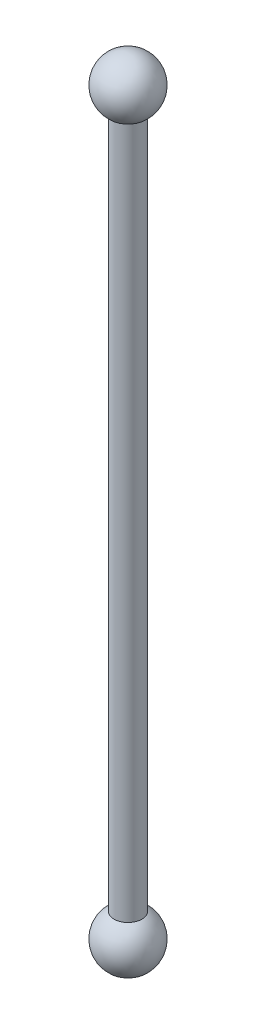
ISO-10303-21;
HEADER;
FILE_DESCRIPTION(('STEP AP214'),'2;1');
FILE_NAME('part.step','',(''),(''),'','','');
FILE_SCHEMA(('AUTOMOTIVE_DESIGN { 1 0 10303 214 1 1 1 1 }'));
ENDSEC;
DATA;
#1=APPLICATION_CONTEXT('core data for automotive mechanical design processes');
#2=APPLICATION_PROTOCOL_DEFINITION('international standard','automotive_design',2000,#1);
#3=PRODUCT_CONTEXT('',#1,'mechanical');
#4=PRODUCT('Part','Part','',(#3));
#5=PRODUCT_RELATED_PRODUCT_CATEGORY('part','',(#4));
#6=PRODUCT_DEFINITION_FORMATION('','',#4);
#7=PRODUCT_DEFINITION_CONTEXT('part definition',#1,'design');
#8=PRODUCT_DEFINITION('design','',#6,#7);
#9=PRODUCT_DEFINITION_SHAPE('','',#8);
#10=(LENGTH_UNIT() NAMED_UNIT(*) SI_UNIT(.MILLI.,.METRE.));
#11=(NAMED_UNIT(*) PLANE_ANGLE_UNIT() SI_UNIT($,.RADIAN.));
#12=(NAMED_UNIT(*) SI_UNIT($,.STERADIAN.) SOLID_ANGLE_UNIT());
#13=UNCERTAINTY_MEASURE_WITH_UNIT(LENGTH_MEASURE(1.E-05),#10,'distance_accuracy_value','');
#14=(GEOMETRIC_REPRESENTATION_CONTEXT(3) GLOBAL_UNCERTAINTY_ASSIGNED_CONTEXT((#13)) GLOBAL_UNIT_ASSIGNED_CONTEXT((#10,
#11,#12)) REPRESENTATION_CONTEXT('',''));
#15=CARTESIAN_POINT('',(0.,0.,0.));
#16=DIRECTION('',(0.,0.,1.));
#17=DIRECTION('',(1.,0.,0.));
#18=AXIS2_PLACEMENT_3D('',#15,#16,#17);
#19=CARTESIAN_POINT('',(0.,400.,0.));
#20=DIRECTION('',(0.,-1.,0.));
#21=DIRECTION('',(0.,0.,-1.));
#22=AXIS2_PLACEMENT_3D('',#19,#20,#21);
#23=CYLINDRICAL_SURFACE('',#22,7.5);
#24=CARTESIAN_POINT('',(0.,12.9903810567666,0.));
#25=DIRECTION('',(0.,-1.,0.));
#26=DIRECTION('',(0.,0.,-1.));
#27=AXIS2_PLACEMENT_3D('',#24,#25,#26);
#28=CIRCLE('',#27,7.5);
#29=CARTESIAN_POINT('',(0.,12.9903810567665,-7.5));
#30=VERTEX_POINT('',#29);
#31=EDGE_CURVE('E38',#30,#30,#28,.F.);
#32=CARTESIAN_POINT('',(0.,387.009618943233,0.));
#33=DIRECTION('',(0.,0.999999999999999,0.));
#34=DIRECTION('',(0.,0.,1.));
#35=AXIS2_PLACEMENT_3D('',#32,#33,#34);
#36=CIRCLE('',#35,7.5);
#37=CARTESIAN_POINT('',(0.,387.009618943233,-7.5));
#38=VERTEX_POINT('',#37);
#39=EDGE_CURVE('E10',#38,#38,#36,.T.);
#40=CARTESIAN_POINT('',(0.,12.9903810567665,-7.5));
#41=CARTESIAN_POINT('',(0.,16.8864147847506,-7.5));
#42=CARTESIAN_POINT('',(0.,20.7824485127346,-7.5));
#43=CARTESIAN_POINT('',(0.,28.5745159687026,-7.5));
#44=CARTESIAN_POINT('',(0.,32.4705496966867,-7.5));
#45=CARTESIAN_POINT('',(0.,40.2626171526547,-7.5));
#46=CARTESIAN_POINT('',(0.,44.1586508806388,-7.5));
#47=CARTESIAN_POINT('',(0.,51.9507183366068,-7.5));
#48=CARTESIAN_POINT('',(0.,55.8467520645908,-7.5));
#49=CARTESIAN_POINT('',(0.,63.6388195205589,-7.5));
#50=CARTESIAN_POINT('',(0.,67.534853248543,-7.5));
#51=CARTESIAN_POINT('',(0.,75.326920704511,-7.5));
#52=CARTESIAN_POINT('',(0.,79.2229544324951,-7.5));
#53=CARTESIAN_POINT('',(0.,87.0150218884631,-7.5));
#54=CARTESIAN_POINT('',(0.,90.9110556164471,-7.5));
#55=CARTESIAN_POINT('',(0.,98.7031230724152,-7.5));
#56=CARTESIAN_POINT('',(0.,102.599156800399,-7.5));
#57=CARTESIAN_POINT('',(0.,110.391224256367,-7.5));
#58=CARTESIAN_POINT('',(0.,114.287257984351,-7.5));
#59=CARTESIAN_POINT('',(0.,122.079325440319,-7.5));
#60=CARTESIAN_POINT('',(0.,125.975359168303,-7.5));
#61=CARTESIAN_POINT('',(0.,133.767426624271,-7.5));
#62=CARTESIAN_POINT('',(0.,137.663460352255,-7.5));
#63=CARTESIAN_POINT('',(0.,145.455527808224,-7.5));
#64=CARTESIAN_POINT('',(0.,149.351561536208,-7.5));
#65=CARTESIAN_POINT('',(0.,157.143628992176,-7.5));
#66=CARTESIAN_POINT('',(0.,161.03966272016,-7.5));
#67=CARTESIAN_POINT('',(0.,168.831730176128,-7.5));
#68=CARTESIAN_POINT('',(0.,172.727763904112,-7.5));
#69=CARTESIAN_POINT('',(0.,180.51983136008,-7.5));
#70=CARTESIAN_POINT('',(0.,184.415865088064,-7.5));
#71=CARTESIAN_POINT('',(0.,192.207932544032,-7.5));
#72=CARTESIAN_POINT('',(0.,196.103966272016,-7.5));
#73=CARTESIAN_POINT('',(0.,203.896033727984,-7.5));
#74=CARTESIAN_POINT('',(0.,207.792067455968,-7.5));
#75=CARTESIAN_POINT('',(0.,215.584134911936,-7.5));
#76=CARTESIAN_POINT('',(0.,219.48016863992,-7.5));
#77=CARTESIAN_POINT('',(0.,227.272236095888,-7.5));
#78=CARTESIAN_POINT('',(0.,231.168269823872,-7.5));
#79=CARTESIAN_POINT('',(0.,238.96033727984,-7.5));
#80=CARTESIAN_POINT('',(0.,242.856371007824,-7.5));
#81=CARTESIAN_POINT('',(0.,250.648438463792,-7.5));
#82=CARTESIAN_POINT('',(0.,254.544472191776,-7.5));
#83=CARTESIAN_POINT('',(0.,262.336539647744,-7.5));
#84=CARTESIAN_POINT('',(0.,266.232573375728,-7.5));
#85=CARTESIAN_POINT('',(0.,274.024640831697,-7.5));
#86=CARTESIAN_POINT('',(0.,277.920674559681,-7.5));
#87=CARTESIAN_POINT('',(0.,285.712742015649,-7.5));
#88=CARTESIAN_POINT('',(0.,289.608775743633,-7.5));
#89=CARTESIAN_POINT('',(0.,297.400843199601,-7.5));
#90=CARTESIAN_POINT('',(0.,301.296876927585,-7.5));
#91=CARTESIAN_POINT('',(0.,309.088944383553,-7.5));
#92=CARTESIAN_POINT('',(0.,312.984978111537,-7.5));
#93=CARTESIAN_POINT('',(0.,320.777045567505,-7.5));
#94=CARTESIAN_POINT('',(0.,324.673079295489,-7.5));
#95=CARTESIAN_POINT('',(0.,332.465146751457,-7.5));
#96=CARTESIAN_POINT('',(0.,336.361180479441,-7.5));
#97=CARTESIAN_POINT('',(0.,344.153247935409,-7.5));
#98=CARTESIAN_POINT('',(0.,348.049281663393,-7.5));
#99=CARTESIAN_POINT('',(0.,355.841349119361,-7.5));
#100=CARTESIAN_POINT('',(0.,359.737382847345,-7.5));
#101=CARTESIAN_POINT('',(0.,367.529450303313,-7.5));
#102=CARTESIAN_POINT('',(0.,371.425484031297,-7.5));
#103=CARTESIAN_POINT('',(0.,379.217551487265,-7.5));
#104=CARTESIAN_POINT('',(0.,383.113585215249,-7.5));
#105=CARTESIAN_POINT('',(0.,387.009618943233,-7.5));
#106=B_SPLINE_CURVE_WITH_KNOTS('',3,(#40,#41,#42,#43,#44,#45,#46,#47,#48,#49,#50,#51,#52,#53,
#54,#55,#56,#57,#58,#59,#60,#61,#62,#63,#64,#65,#66,#67,#68,#69,#70,#71,#72,#73,#74,#75,#76,#77,
#78,#79,#80,#81,#82,#83,#84,#85,#86,#87,#88,#89,#90,#91,#92,#93,#94,#95,#96,#97,#98,#99,#100,
#101,#102,#103,#104,#105),.UNSPECIFIED.,.F.,.F.,(4,2,2,2,2,2,2,2,2,2,2,2,2,2,2,2,2,2,2,2,2,2,2,
2,2,2,2,2,2,2,2,2,4),(0.,11.6881011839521,23.3762023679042,35.0643035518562,46.7524047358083,
58.4405059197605,70.1286071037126,81.8167082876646,93.5048094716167,105.192910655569,
116.881011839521,128.569113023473,140.257214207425,151.945315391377,163.633416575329,
175.321517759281,187.009618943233,198.697720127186,210.385821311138,222.07392249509,
233.762023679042,245.450124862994,257.138226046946,268.826327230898,280.51442841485,
292.202529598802,303.890630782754,315.578731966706,327.266833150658,338.954934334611,
350.643035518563,362.331136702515,374.019237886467),.UNSPECIFIED.);
#107=EDGE_CURVE('BSEAM31',#30,#38,#106,.T.);
#108=ORIENTED_EDGE('',*,*,#31,.T.);
#109=ORIENTED_EDGE('',*,*,#39,.F.);
#110=ORIENTED_EDGE('',*,*,#107,.T.);
#111=ORIENTED_EDGE('',*,*,#107,.F.);
#112=EDGE_LOOP('',(#108,#110,#109,#111));
#113=FACE_BOUND('',#112,.T.);
#114=ADVANCED_FACE('F31',(#113),#23,.T.);
#115=CARTESIAN_POINT('',(0.,0.,0.));
#116=DIRECTION('',(0.,1.,0.));
#117=DIRECTION('',(1.,0.,0.));
#118=AXIS2_PLACEMENT_3D('',#115,#116,#117);
#119=SPHERICAL_SURFACE('',#118,15.);
#120=ORIENTED_EDGE('',*,*,#31,.F.);
#121=EDGE_LOOP('',(#120));
#122=FACE_BOUND('',#121,.T.);
#123=ADVANCED_FACE('F33',(#122),#119,.T.);
#124=CARTESIAN_POINT('',(0.,400.,0.));
#125=DIRECTION('',(0.,1.,0.));
#126=DIRECTION('',(-1.,0.,0.));
#127=AXIS2_PLACEMENT_3D('',#124,#125,#126);
#128=SPHERICAL_SURFACE('',#127,15.);
#129=ORIENTED_EDGE('',*,*,#39,.T.);
#130=EDGE_LOOP('',(#129));
#131=FACE_BOUND('',#130,.T.);
#132=ADVANCED_FACE('F47',(#131),#128,.T.);
#133=CLOSED_SHELL('',(#114,#123,#132));
#134=MANIFOLD_SOLID_BREP('B2',#133);
#135=ADVANCED_BREP_SHAPE_REPRESENTATION('',(#18,#134),#14);
#136=SHAPE_DEFINITION_REPRESENTATION(#9,#135);
ENDSEC;
END-ISO-10303-21;
